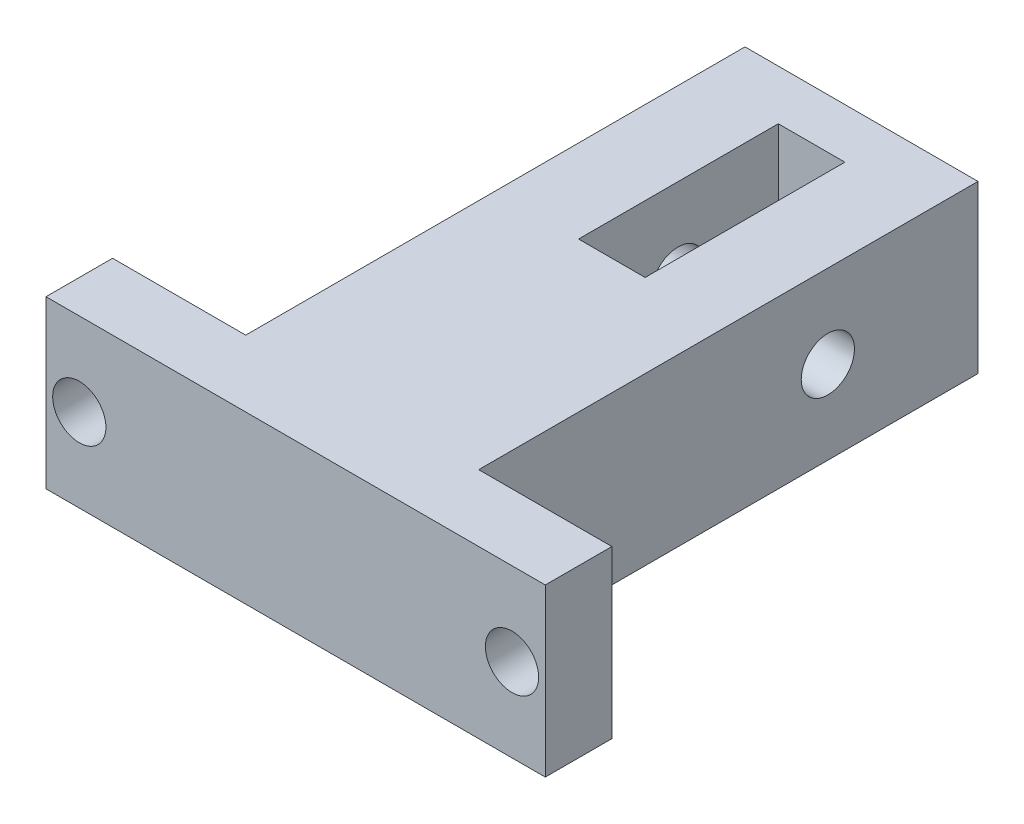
from build123d import *

# Parameters (mm, degrees)
SKETCH2_W               = 4
SKETCH2_H               = 12
BOSS_EXTRUDE1_DEPTH     = 10
CUT_EXTRUDE1_DEPTH      = 1
CUT_EXTRUDE1_DEPTH_BACK = 6
SKETCH3_R               = 1.6
CUT_EXTRUDE2_DEPTH      = 9
CUT_EXTRUDE2_DEPTH_BACK = 9
SKETCH4_R               = 1.6


with BuildPart() as part:
    # Sketch2 → Boss-Extrude1 (new body)
    with BuildSketch(Plane(origin=(0, 0, 0), x_dir=(1, 0, 0), z_dir=(0, 1, 0))):
        Polygon((-15, 0), (15, 0), (15, 4), (7, 4), (7, 31), (7, 34), (-7, 34), (-7, 31), (-7, 4), (-15, 4), align=None)
        with Locations((0, 25)):
            Rectangle(SKETCH2_W, SKETCH2_H, mode=Mode.SUBTRACT)
    extrude(amount=BOSS_EXTRUDE1_DEPTH)

    # Sketch3 → Cut-Extrude1 (cut, two sides: drawn at the far end of the back side and taken through both)
    with BuildSketch(Plane.XY.offset(-CUT_EXTRUDE1_DEPTH_BACK)):
        with Locations((13, 5)):
            Circle(SKETCH3_R)
        with Locations((-13, 5)):
            Circle(SKETCH3_R)
    extrude(amount=CUT_EXTRUDE1_DEPTH + CUT_EXTRUDE1_DEPTH_BACK, mode=Mode.SUBTRACT)

    # Sketch4 → Cut-Extrude2 (cut, two sides: drawn at the far end of the back side and taken through both)
    with BuildSketch(Plane(origin=(0, 0, 0), x_dir=(0, 0, -1), z_dir=(1, 0, 0)).offset(-CUT_EXTRUDE2_DEPTH_BACK)):
        with Locations(Location((24.978148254, 5, 0), (0, 0, 180))):
            Circle(SKETCH4_R)
    extrude(amount=CUT_EXTRUDE2_DEPTH + CUT_EXTRUDE2_DEPTH_BACK, mode=Mode.SUBTRACT)


solid = part.part
